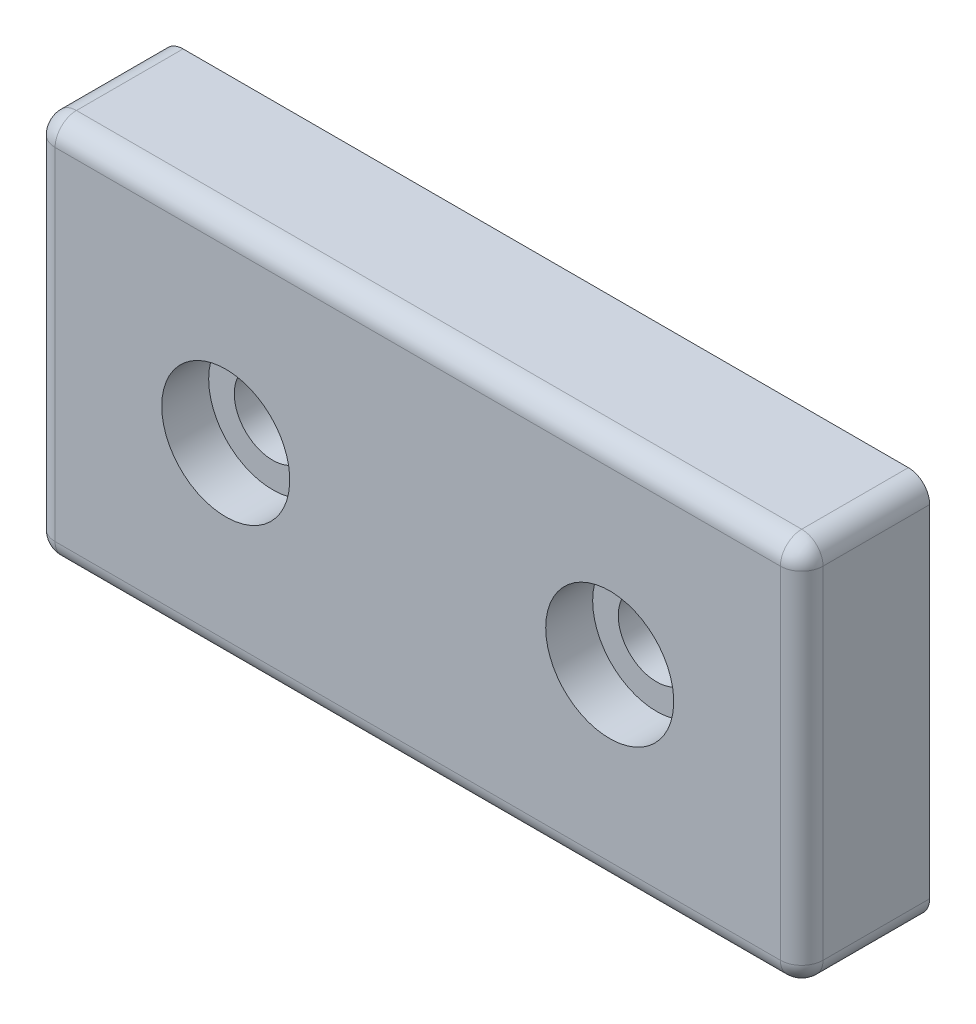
ISO-10303-21;
HEADER;
FILE_DESCRIPTION(('STEP AP214'),'2;1');
FILE_NAME('part.step','',(''),(''),'','','');
FILE_SCHEMA(('AUTOMOTIVE_DESIGN { 1 0 10303 214 1 1 1 1 }'));
ENDSEC;
DATA;
#1=APPLICATION_CONTEXT('core data for automotive mechanical design processes');
#2=APPLICATION_PROTOCOL_DEFINITION('international standard','automotive_design',2000,#1);
#3=PRODUCT_CONTEXT('',#1,'mechanical');
#4=PRODUCT('Part','Part','',(#3));
#5=PRODUCT_RELATED_PRODUCT_CATEGORY('part','',(#4));
#6=PRODUCT_DEFINITION_FORMATION('','',#4);
#7=PRODUCT_DEFINITION_CONTEXT('part definition',#1,'design');
#8=PRODUCT_DEFINITION('design','',#6,#7);
#9=PRODUCT_DEFINITION_SHAPE('','',#8);
#10=(LENGTH_UNIT() NAMED_UNIT(*) SI_UNIT(.MILLI.,.METRE.));
#11=(NAMED_UNIT(*) PLANE_ANGLE_UNIT() SI_UNIT($,.RADIAN.));
#12=(NAMED_UNIT(*) SI_UNIT($,.STERADIAN.) SOLID_ANGLE_UNIT());
#13=UNCERTAINTY_MEASURE_WITH_UNIT(LENGTH_MEASURE(1.E-05),#10,'distance_accuracy_value','');
#14=(GEOMETRIC_REPRESENTATION_CONTEXT(3) GLOBAL_UNCERTAINTY_ASSIGNED_CONTEXT((#13)) GLOBAL_UNIT_ASSIGNED_CONTEXT((#10,
#11,#12)) REPRESENTATION_CONTEXT('',''));
#15=CARTESIAN_POINT('',(0.,0.,0.));
#16=DIRECTION('',(0.,0.,1.));
#17=DIRECTION('',(1.,0.,0.));
#18=AXIS2_PLACEMENT_3D('',#15,#16,#17);
#19=CARTESIAN_POINT('',(0.,0.,15.));
#20=DIRECTION('',(0.,0.,1.));
#21=DIRECTION('',(1.,0.,0.));
#22=AXIS2_PLACEMENT_3D('',#19,#20,#21);
#23=PLANE('',#22);
#24=CARTESIAN_POINT('',(22.5,0.,15.));
#25=DIRECTION('',(0.,0.,-1.));
#26=DIRECTION('',(-1.,0.,0.));
#27=AXIS2_PLACEMENT_3D('',#24,#25,#26);
#28=CIRCLE('',#27,7.5);
#29=CARTESIAN_POINT('',(15.,0.,15.));
#30=VERTEX_POINT('',#29);
#31=EDGE_CURVE('E106',#30,#30,#28,.T.);
#32=ORIENTED_EDGE('',*,*,#31,.T.);
#33=EDGE_LOOP('',(#32));
#34=FACE_BOUND('',#33,.T.);
#35=CARTESIAN_POINT('',(-22.5,0.,15.));
#36=DIRECTION('',(0.,0.,-1.));
#37=DIRECTION('',(-1.,0.,0.));
#38=AXIS2_PLACEMENT_3D('',#35,#36,#37);
#39=CIRCLE('',#38,7.5);
#40=CARTESIAN_POINT('',(-30.,0.,15.));
#41=VERTEX_POINT('',#40);
#42=EDGE_CURVE('E19',#41,#41,#39,.T.);
#43=ORIENTED_EDGE('',*,*,#42,.T.);
#44=EDGE_LOOP('',(#43));
#45=FACE_BOUND('',#44,.T.);
#46=DIRECTION('',(-1.,0.,0.));
#47=VECTOR('',#46,1.);
#48=CARTESIAN_POINT('',(22.5,-20.,15.));
#49=LINE('',#48,#47);
#50=CARTESIAN_POINT('',(42.5,-20.0000000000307,15.));
#51=VERTEX_POINT('',#50);
#52=CARTESIAN_POINT('',(-42.5,-20.,15.));
#53=VERTEX_POINT('',#52);
#54=EDGE_CURVE('E315',#51,#53,#49,.T.);
#55=ORIENTED_EDGE('',*,*,#54,.F.);
#56=DIRECTION('',(0.,-1.,0.));
#57=VECTOR('',#56,1.);
#58=CARTESIAN_POINT('',(42.5,11.25,15.));
#59=LINE('',#58,#57);
#60=CARTESIAN_POINT('',(42.5,20.,15.));
#61=VERTEX_POINT('',#60);
#62=EDGE_CURVE('E194',#61,#51,#59,.T.);
#63=ORIENTED_EDGE('',*,*,#62,.F.);
#64=DIRECTION('',(1.,0.,0.));
#65=VECTOR('',#64,1.);
#66=CARTESIAN_POINT('',(-22.5,20.,15.));
#67=LINE('',#66,#65);
#68=CARTESIAN_POINT('',(-42.5,20.0000000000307,15.));
#69=VERTEX_POINT('',#68);
#70=EDGE_CURVE('E108',#69,#61,#67,.T.);
#71=ORIENTED_EDGE('',*,*,#70,.F.);
#72=DIRECTION('',(0.,1.,0.));
#73=VECTOR('',#72,1.);
#74=CARTESIAN_POINT('',(-42.5,-11.25,15.));
#75=LINE('',#74,#73);
#76=EDGE_CURVE('E237',#53,#69,#75,.T.);
#77=ORIENTED_EDGE('',*,*,#76,.F.);
#78=EDGE_LOOP('',(#55,#63,#71,#77));
#79=FACE_BOUND('',#78,.T.);
#80=ADVANCED_FACE('F15',(#34,#45,#79),#23,.T.);
#81=CARTESIAN_POINT('',(-22.5,0.,15.));
#82=DIRECTION('',(0.,0.,-1.));
#83=DIRECTION('',(-1.,0.,0.));
#84=AXIS2_PLACEMENT_3D('',#81,#82,#83);
#85=CYLINDRICAL_SURFACE('',#84,7.5);
#86=CARTESIAN_POINT('',(-22.5,0.,9.5));
#87=DIRECTION('',(0.,0.,-1.));
#88=DIRECTION('',(-1.,0.,0.));
#89=AXIS2_PLACEMENT_3D('',#86,#87,#88);
#90=CIRCLE('',#89,7.5);
#91=CARTESIAN_POINT('',(-30.,0.,9.5));
#92=VERTEX_POINT('',#91);
#93=EDGE_CURVE('E103',#92,#92,#90,.T.);
#94=ORIENTED_EDGE('',*,*,#93,.T.);
#95=EDGE_LOOP('',(#94));
#96=FACE_BOUND('',#95,.T.);
#97=ORIENTED_EDGE('',*,*,#42,.F.);
#98=EDGE_LOOP('',(#97));
#99=FACE_BOUND('',#98,.T.);
#100=ADVANCED_FACE('F119',(#96,#99),#85,.F.);
#101=CARTESIAN_POINT('',(22.5,0.,15.));
#102=DIRECTION('',(0.,0.,-1.));
#103=DIRECTION('',(-1.,0.,0.));
#104=AXIS2_PLACEMENT_3D('',#101,#102,#103);
#105=CYLINDRICAL_SURFACE('',#104,7.5);
#106=CARTESIAN_POINT('',(22.5,0.,9.5));
#107=DIRECTION('',(0.,0.,-1.));
#108=DIRECTION('',(-1.,0.,0.));
#109=AXIS2_PLACEMENT_3D('',#106,#107,#108);
#110=CIRCLE('',#109,7.5);
#111=CARTESIAN_POINT('',(15.,0.,9.5));
#112=VERTEX_POINT('',#111);
#113=EDGE_CURVE('E99',#112,#112,#110,.T.);
#114=ORIENTED_EDGE('',*,*,#113,.T.);
#115=EDGE_LOOP('',(#114));
#116=FACE_BOUND('',#115,.T.);
#117=ORIENTED_EDGE('',*,*,#31,.F.);
#118=EDGE_LOOP('',(#117));
#119=FACE_BOUND('',#118,.T.);
#120=ADVANCED_FACE('F121',(#116,#119),#105,.F.);
#121=CARTESIAN_POINT('',(-22.5,20.,12.5));
#122=DIRECTION('',(1.,0.,0.));
#123=DIRECTION('',(0.,1.,0.));
#124=AXIS2_PLACEMENT_3D('',#121,#122,#123);
#125=CYLINDRICAL_SURFACE('',#124,2.5);
#126=CARTESIAN_POINT('',(-42.5,20.,12.5));
#127=DIRECTION('',(1.,0.,0.));
#128=DIRECTION('',(0.,1.,0.));
#129=AXIS2_PLACEMENT_3D('',#126,#127,#128);
#130=CIRCLE('',#129,2.5);
#131=CARTESIAN_POINT('',(-42.5,22.5,12.5));
#132=VERTEX_POINT('',#131);
#133=EDGE_CURVE('E112',#69,#132,#130,.F.);
#134=ORIENTED_EDGE('',*,*,#133,.F.);
#135=ORIENTED_EDGE('',*,*,#70,.T.);
#136=CARTESIAN_POINT('',(42.5,20.,12.5));
#137=DIRECTION('',(1.,0.,0.));
#138=DIRECTION('',(0.,1.,0.));
#139=AXIS2_PLACEMENT_3D('',#136,#137,#138);
#140=CIRCLE('',#139,2.5);
#141=CARTESIAN_POINT('',(42.5,22.5,12.5));
#142=VERTEX_POINT('',#141);
#143=EDGE_CURVE('E191',#142,#61,#140,.T.);
#144=ORIENTED_EDGE('',*,*,#143,.F.);
#145=DIRECTION('',(1.,0.,0.));
#146=VECTOR('',#145,1.);
#147=CARTESIAN_POINT('',(-45.,22.5,12.5));
#148=LINE('',#147,#146);
#149=EDGE_CURVE('E102',#132,#142,#148,.T.);
#150=ORIENTED_EDGE('',*,*,#149,.F.);
#151=EDGE_LOOP('',(#134,#135,#144,#150));
#152=FACE_BOUND('',#151,.T.);
#153=ADVANCED_FACE('F129',(#152),#125,.T.);
#154=CARTESIAN_POINT('',(-42.5,20.,12.5));
#155=DIRECTION('',(1.,0.,0.));
#156=DIRECTION('',(0.,1.,0.));
#157=AXIS2_PLACEMENT_3D('',#154,#155,#156);
#158=SPHERICAL_SURFACE('',#157,2.5);
#159=ORIENTED_EDGE('',*,*,#133,.T.);
#160=CARTESIAN_POINT('',(-42.5,20.,12.5));
#161=DIRECTION('',(0.,0.,1.));
#162=DIRECTION('',(1.,0.,0.));
#163=AXIS2_PLACEMENT_3D('',#160,#161,#162);
#164=CIRCLE('',#163,2.5);
#165=CARTESIAN_POINT('',(-45.,20.,12.5));
#166=VERTEX_POINT('',#165);
#167=EDGE_CURVE('E197',#166,#132,#164,.F.);
#168=ORIENTED_EDGE('',*,*,#167,.F.);
#169=CARTESIAN_POINT('',(-42.5,20.,12.5));
#170=DIRECTION('',(0.,1.,0.));
#171=DIRECTION('',(-1.,0.,0.));
#172=AXIS2_PLACEMENT_3D('',#169,#170,#171);
#173=CIRCLE('',#172,2.5);
#174=EDGE_CURVE('E238',#69,#166,#173,.F.);
#175=ORIENTED_EDGE('',*,*,#174,.F.);
#176=EDGE_LOOP('',(#159,#168,#175));
#177=FACE_BOUND('',#176,.T.);
#178=ADVANCED_FACE('F245',(#177),#158,.T.);
#179=CARTESIAN_POINT('',(-42.5,-11.25,12.5));
#180=DIRECTION('',(0.,1.,0.));
#181=DIRECTION('',(-1.,0.,0.));
#182=AXIS2_PLACEMENT_3D('',#179,#180,#181);
#183=CYLINDRICAL_SURFACE('',#182,2.5);
#184=CARTESIAN_POINT('',(-42.5,-20.,12.5));
#185=DIRECTION('',(0.,-1.,0.));
#186=DIRECTION('',(1.,0.,0.));
#187=AXIS2_PLACEMENT_3D('',#184,#185,#186);
#188=CIRCLE('',#187,2.5);
#189=CARTESIAN_POINT('',(-45.,-20.,12.5));
#190=VERTEX_POINT('',#189);
#191=EDGE_CURVE('E233',#53,#190,#188,.T.);
#192=ORIENTED_EDGE('',*,*,#191,.F.);
#193=ORIENTED_EDGE('',*,*,#76,.T.);
#194=ORIENTED_EDGE('',*,*,#174,.T.);
#195=DIRECTION('',(0.,1.,0.));
#196=VECTOR('',#195,1.);
#197=CARTESIAN_POINT('',(-45.,-22.5,12.5));
#198=LINE('',#197,#196);
#199=EDGE_CURVE('E74',#190,#166,#198,.T.);
#200=ORIENTED_EDGE('',*,*,#199,.F.);
#201=EDGE_LOOP('',(#192,#193,#194,#200));
#202=FACE_BOUND('',#201,.T.);
#203=ADVANCED_FACE('F226',(#202),#183,.T.);
#204=CARTESIAN_POINT('',(-42.5,-20.,12.5));
#205=DIRECTION('',(1.,0.,0.));
#206=DIRECTION('',(0.,1.,0.));
#207=AXIS2_PLACEMENT_3D('',#204,#205,#206);
#208=SPHERICAL_SURFACE('',#207,2.5);
#209=ORIENTED_EDGE('',*,*,#191,.T.);
#210=CARTESIAN_POINT('',(-42.5,-20.,12.5));
#211=DIRECTION('',(0.,0.,1.));
#212=DIRECTION('',(1.,0.,0.));
#213=AXIS2_PLACEMENT_3D('',#210,#211,#212);
#214=CIRCLE('',#213,2.5);
#215=CARTESIAN_POINT('',(-42.5,-22.5,12.5));
#216=VERTEX_POINT('',#215);
#217=EDGE_CURVE('E310',#216,#190,#214,.F.);
#218=ORIENTED_EDGE('',*,*,#217,.F.);
#219=CARTESIAN_POINT('',(-42.5,-20.,12.5));
#220=DIRECTION('',(-1.,0.,0.));
#221=DIRECTION('',(0.,0.,1.));
#222=AXIS2_PLACEMENT_3D('',#219,#220,#221);
#223=CIRCLE('',#222,2.5);
#224=EDGE_CURVE('E236',#53,#216,#223,.F.);
#225=ORIENTED_EDGE('',*,*,#224,.F.);
#226=EDGE_LOOP('',(#209,#218,#225));
#227=FACE_BOUND('',#226,.T.);
#228=ADVANCED_FACE('F221',(#227),#208,.T.);
#229=CARTESIAN_POINT('',(22.5,-20.,12.5));
#230=DIRECTION('',(-1.,0.,0.));
#231=DIRECTION('',(0.,0.,1.));
#232=AXIS2_PLACEMENT_3D('',#229,#230,#231);
#233=CYLINDRICAL_SURFACE('',#232,2.5);
#234=CARTESIAN_POINT('',(42.5,-20.,12.5));
#235=DIRECTION('',(1.,0.,0.));
#236=DIRECTION('',(0.,1.,0.));
#237=AXIS2_PLACEMENT_3D('',#234,#235,#236);
#238=CIRCLE('',#237,2.5);
#239=CARTESIAN_POINT('',(42.5,-22.5,12.5));
#240=VERTEX_POINT('',#239);
#241=EDGE_CURVE('E206',#51,#240,#238,.T.);
#242=ORIENTED_EDGE('',*,*,#241,.F.);
#243=ORIENTED_EDGE('',*,*,#54,.T.);
#244=ORIENTED_EDGE('',*,*,#224,.T.);
#245=DIRECTION('',(1.,0.,0.));
#246=VECTOR('',#245,1.);
#247=CARTESIAN_POINT('',(45.,-22.5,12.5));
#248=LINE('',#247,#246);
#249=EDGE_CURVE('E207',#240,#216,#248,.F.);
#250=ORIENTED_EDGE('',*,*,#249,.F.);
#251=EDGE_LOOP('',(#242,#243,#244,#250));
#252=FACE_BOUND('',#251,.T.);
#253=ADVANCED_FACE('F217',(#252),#233,.T.);
#254=CARTESIAN_POINT('',(42.5,-20.,12.5));
#255=DIRECTION('',(1.,0.,0.));
#256=DIRECTION('',(0.,1.,0.));
#257=AXIS2_PLACEMENT_3D('',#254,#255,#256);
#258=SPHERICAL_SURFACE('',#257,2.5);
#259=CARTESIAN_POINT('',(42.5,-20.,12.5));
#260=DIRECTION('',(0.,-1.,0.));
#261=DIRECTION('',(1.,0.,0.));
#262=AXIS2_PLACEMENT_3D('',#259,#260,#261);
#263=CIRCLE('',#262,2.5);
#264=CARTESIAN_POINT('',(45.,-20.,12.5));
#265=VERTEX_POINT('',#264);
#266=EDGE_CURVE('E203',#51,#265,#263,.F.);
#267=ORIENTED_EDGE('',*,*,#266,.F.);
#268=ORIENTED_EDGE('',*,*,#241,.T.);
#269=CARTESIAN_POINT('',(42.5,-20.,12.5));
#270=DIRECTION('',(0.,0.,1.));
#271=DIRECTION('',(1.,0.,0.));
#272=AXIS2_PLACEMENT_3D('',#269,#270,#271);
#273=CIRCLE('',#272,2.5);
#274=EDGE_CURVE('E198',#265,#240,#273,.F.);
#275=ORIENTED_EDGE('',*,*,#274,.F.);
#276=EDGE_LOOP('',(#267,#268,#275));
#277=FACE_BOUND('',#276,.T.);
#278=ADVANCED_FACE('F214',(#277),#258,.T.);
#279=CARTESIAN_POINT('',(42.5,11.25,12.5));
#280=DIRECTION('',(0.,-1.,0.));
#281=DIRECTION('',(1.,0.,0.));
#282=AXIS2_PLACEMENT_3D('',#279,#280,#281);
#283=CYLINDRICAL_SURFACE('',#282,2.5);
#284=CARTESIAN_POINT('',(42.5,20.,12.5));
#285=DIRECTION('',(0.,-1.,0.));
#286=DIRECTION('',(1.,0.,0.));
#287=AXIS2_PLACEMENT_3D('',#284,#285,#286);
#288=CIRCLE('',#287,2.5);
#289=CARTESIAN_POINT('',(45.,20.,12.5));
#290=VERTEX_POINT('',#289);
#291=EDGE_CURVE('E105',#61,#290,#288,.F.);
#292=ORIENTED_EDGE('',*,*,#291,.F.);
#293=ORIENTED_EDGE('',*,*,#62,.T.);
#294=ORIENTED_EDGE('',*,*,#266,.T.);
#295=DIRECTION('',(0.,1.,0.));
#296=VECTOR('',#295,1.);
#297=CARTESIAN_POINT('',(45.,22.5,12.5));
#298=LINE('',#297,#296);
#299=EDGE_CURVE('E298',#290,#265,#298,.F.);
#300=ORIENTED_EDGE('',*,*,#299,.F.);
#301=EDGE_LOOP('',(#292,#293,#294,#300));
#302=FACE_BOUND('',#301,.T.);
#303=ADVANCED_FACE('F181',(#302),#283,.T.);
#304=CARTESIAN_POINT('',(42.5,20.,12.5));
#305=DIRECTION('',(1.,0.,0.));
#306=DIRECTION('',(0.,1.,0.));
#307=AXIS2_PLACEMENT_3D('',#304,#305,#306);
#308=SPHERICAL_SURFACE('',#307,2.5);
#309=ORIENTED_EDGE('',*,*,#143,.T.);
#310=ORIENTED_EDGE('',*,*,#291,.T.);
#311=CARTESIAN_POINT('',(42.5,20.,12.5));
#312=DIRECTION('',(0.,0.,1.));
#313=DIRECTION('',(1.,0.,0.));
#314=AXIS2_PLACEMENT_3D('',#311,#312,#313);
#315=CIRCLE('',#314,2.5);
#316=EDGE_CURVE('E187',#142,#290,#315,.F.);
#317=ORIENTED_EDGE('',*,*,#316,.F.);
#318=EDGE_LOOP('',(#309,#310,#317));
#319=FACE_BOUND('',#318,.T.);
#320=ADVANCED_FACE('F176',(#319),#308,.T.);
#321=CARTESIAN_POINT('',(-30.15,7.65,9.5));
#322=DIRECTION('',(0.,0.,-1.));
#323=DIRECTION('',(1.,0.,0.));
#324=AXIS2_PLACEMENT_3D('',#321,#322,#323);
#325=PLANE('',#324);
#326=CARTESIAN_POINT('',(-22.5,0.,9.5));
#327=DIRECTION('',(0.,0.,1.));
#328=DIRECTION('',(1.,0.,0.));
#329=AXIS2_PLACEMENT_3D('',#326,#327,#328);
#330=CIRCLE('',#329,4.5);
#331=CARTESIAN_POINT('',(-18.,0.,9.5));
#332=VERTEX_POINT('',#331);
#333=EDGE_CURVE('E96',#332,#332,#330,.F.);
#334=ORIENTED_EDGE('',*,*,#333,.T.);
#335=EDGE_LOOP('',(#334));
#336=FACE_BOUND('',#335,.T.);
#337=ORIENTED_EDGE('',*,*,#93,.F.);
#338=EDGE_LOOP('',(#337));
#339=FACE_BOUND('',#338,.T.);
#340=ADVANCED_FACE('F180',(#336,#339),#325,.F.);
#341=CARTESIAN_POINT('',(14.85,7.65,9.5));
#342=DIRECTION('',(0.,0.,-1.));
#343=DIRECTION('',(1.,0.,0.));
#344=AXIS2_PLACEMENT_3D('',#341,#342,#343);
#345=PLANE('',#344);
#346=CARTESIAN_POINT('',(22.5,0.,9.5));
#347=DIRECTION('',(0.,0.,1.));
#348=DIRECTION('',(1.,0.,0.));
#349=AXIS2_PLACEMENT_3D('',#346,#347,#348);
#350=CIRCLE('',#349,4.5);
#351=CARTESIAN_POINT('',(27.,0.,9.5));
#352=VERTEX_POINT('',#351);
#353=EDGE_CURVE('E89',#352,#352,#350,.F.);
#354=ORIENTED_EDGE('',*,*,#353,.T.);
#355=EDGE_LOOP('',(#354));
#356=FACE_BOUND('',#355,.T.);
#357=ORIENTED_EDGE('',*,*,#113,.F.);
#358=EDGE_LOOP('',(#357));
#359=FACE_BOUND('',#358,.T.);
#360=ADVANCED_FACE('F17',(#356,#359),#345,.F.);
#361=CARTESIAN_POINT('',(-45.,22.5,0.));
#362=DIRECTION('',(0.,1.,0.));
#363=DIRECTION('',(0.,0.,1.));
#364=AXIS2_PLACEMENT_3D('',#361,#362,#363);
#365=PLANE('',#364);
#366=DIRECTION('',(0.,0.,1.));
#367=VECTOR('',#366,1.);
#368=CARTESIAN_POINT('',(-42.5,22.5,0.));
#369=LINE('',#368,#367);
#370=CARTESIAN_POINT('',(-42.5,22.5,0.));
#371=VERTEX_POINT('',#370);
#372=EDGE_CURVE('E60',#132,#371,#369,.F.);
#373=ORIENTED_EDGE('',*,*,#372,.F.);
#374=ORIENTED_EDGE('',*,*,#149,.T.);
#375=DIRECTION('',(0.,0.,1.));
#376=VECTOR('',#375,1.);
#377=CARTESIAN_POINT('',(42.5,22.5,0.));
#378=LINE('',#377,#376);
#379=CARTESIAN_POINT('',(42.5,22.5,0.));
#380=VERTEX_POINT('',#379);
#381=EDGE_CURVE('E296',#380,#142,#378,.T.);
#382=ORIENTED_EDGE('',*,*,#381,.F.);
#383=DIRECTION('',(1.,0.,0.));
#384=VECTOR('',#383,1.);
#385=CARTESIAN_POINT('',(0.,22.5,0.));
#386=LINE('',#385,#384);
#387=EDGE_CURVE('E87',#380,#371,#386,.F.);
#388=ORIENTED_EDGE('',*,*,#387,.T.);
#389=EDGE_LOOP('',(#373,#374,#382,#388));
#390=FACE_BOUND('',#389,.T.);
#391=ADVANCED_FACE('F172',(#390),#365,.T.);
#392=CARTESIAN_POINT('',(-42.5,20.,0.));
#393=DIRECTION('',(0.,0.,1.));
#394=DIRECTION('',(1.,0.,0.));
#395=AXIS2_PLACEMENT_3D('',#392,#393,#394);
#396=CYLINDRICAL_SURFACE('',#395,2.5);
#397=ORIENTED_EDGE('',*,*,#167,.T.);
#398=ORIENTED_EDGE('',*,*,#372,.T.);
#399=CARTESIAN_POINT('',(-42.5,20.,0.));
#400=DIRECTION('',(0.,0.,1.));
#401=DIRECTION('',(1.,0.,0.));
#402=AXIS2_PLACEMENT_3D('',#399,#400,#401);
#403=CIRCLE('',#402,2.5);
#404=CARTESIAN_POINT('',(-45.,20.,0.));
#405=VERTEX_POINT('',#404);
#406=EDGE_CURVE('E80',#371,#405,#403,.T.);
#407=ORIENTED_EDGE('',*,*,#406,.T.);
#408=DIRECTION('',(0.,0.,1.));
#409=VECTOR('',#408,1.);
#410=CARTESIAN_POINT('',(-45.,20.,0.));
#411=LINE('',#410,#409);
#412=EDGE_CURVE('E67',#166,#405,#411,.F.);
#413=ORIENTED_EDGE('',*,*,#412,.F.);
#414=EDGE_LOOP('',(#397,#398,#407,#413));
#415=FACE_BOUND('',#414,.T.);
#416=ADVANCED_FACE('F86',(#415),#396,.T.);
#417=CARTESIAN_POINT('',(-45.,-22.5,0.));
#418=DIRECTION('',(-1.,0.,0.));
#419=DIRECTION('',(0.,0.,1.));
#420=AXIS2_PLACEMENT_3D('',#417,#418,#419);
#421=PLANE('',#420);
#422=DIRECTION('',(0.,0.,1.));
#423=VECTOR('',#422,1.);
#424=CARTESIAN_POINT('',(-45.,-20.,0.));
#425=LINE('',#424,#423);
#426=CARTESIAN_POINT('',(-45.,-20.,0.));
#427=VERTEX_POINT('',#426);
#428=EDGE_CURVE('E210',#190,#427,#425,.F.);
#429=ORIENTED_EDGE('',*,*,#428,.F.);
#430=ORIENTED_EDGE('',*,*,#199,.T.);
#431=ORIENTED_EDGE('',*,*,#412,.T.);
#432=DIRECTION('',(0.,1.,0.));
#433=VECTOR('',#432,1.);
#434=CARTESIAN_POINT('',(-45.,0.,0.));
#435=LINE('',#434,#433);
#436=EDGE_CURVE('E71',#405,#427,#435,.F.);
#437=ORIENTED_EDGE('',*,*,#436,.T.);
#438=EDGE_LOOP('',(#429,#430,#431,#437));
#439=FACE_BOUND('',#438,.T.);
#440=ADVANCED_FACE('F70',(#439),#421,.T.);
#441=CARTESIAN_POINT('',(-42.5,-20.,0.));
#442=DIRECTION('',(0.,0.,1.));
#443=DIRECTION('',(1.,0.,0.));
#444=AXIS2_PLACEMENT_3D('',#441,#442,#443);
#445=CYLINDRICAL_SURFACE('',#444,2.5);
#446=ORIENTED_EDGE('',*,*,#217,.T.);
#447=ORIENTED_EDGE('',*,*,#428,.T.);
#448=CARTESIAN_POINT('',(-42.5,-20.,0.));
#449=DIRECTION('',(0.,0.,1.));
#450=DIRECTION('',(1.,0.,0.));
#451=AXIS2_PLACEMENT_3D('',#448,#449,#450);
#452=CIRCLE('',#451,2.5);
#453=CARTESIAN_POINT('',(-42.5,-22.5,0.));
#454=VERTEX_POINT('',#453);
#455=EDGE_CURVE('E84',#427,#454,#452,.T.);
#456=ORIENTED_EDGE('',*,*,#455,.T.);
#457=DIRECTION('',(0.,0.,-1.));
#458=VECTOR('',#457,1.);
#459=CARTESIAN_POINT('',(-42.5,-22.5,0.));
#460=LINE('',#459,#458);
#461=EDGE_CURVE('E202',#216,#454,#460,.T.);
#462=ORIENTED_EDGE('',*,*,#461,.F.);
#463=EDGE_LOOP('',(#446,#447,#456,#462));
#464=FACE_BOUND('',#463,.T.);
#465=ADVANCED_FACE('F163',(#464),#445,.T.);
#466=CARTESIAN_POINT('',(45.,-22.5,0.));
#467=DIRECTION('',(0.,-1.,0.));
#468=DIRECTION('',(0.,0.,-1.));
#469=AXIS2_PLACEMENT_3D('',#466,#467,#468);
#470=PLANE('',#469);
#471=ORIENTED_EDGE('',*,*,#461,.T.);
#472=DIRECTION('',(1.,0.,0.));
#473=VECTOR('',#472,1.);
#474=CARTESIAN_POINT('',(0.,-22.5,0.));
#475=LINE('',#474,#473);
#476=CARTESIAN_POINT('',(42.5,-22.5,0.));
#477=VERTEX_POINT('',#476);
#478=EDGE_CURVE('E326',#454,#477,#475,.T.);
#479=ORIENTED_EDGE('',*,*,#478,.T.);
#480=DIRECTION('',(0.,0.,1.));
#481=VECTOR('',#480,1.);
#482=CARTESIAN_POINT('',(42.5,-22.5,0.));
#483=LINE('',#482,#481);
#484=EDGE_CURVE('E201',#240,#477,#483,.F.);
#485=ORIENTED_EDGE('',*,*,#484,.F.);
#486=ORIENTED_EDGE('',*,*,#249,.T.);
#487=EDGE_LOOP('',(#471,#479,#485,#486));
#488=FACE_BOUND('',#487,.T.);
#489=ADVANCED_FACE('F159',(#488),#470,.T.);
#490=CARTESIAN_POINT('',(42.5,-20.,0.));
#491=DIRECTION('',(0.,0.,1.));
#492=DIRECTION('',(1.,0.,0.));
#493=AXIS2_PLACEMENT_3D('',#490,#491,#492);
#494=CYLINDRICAL_SURFACE('',#493,2.5);
#495=ORIENTED_EDGE('',*,*,#274,.T.);
#496=ORIENTED_EDGE('',*,*,#484,.T.);
#497=CARTESIAN_POINT('',(42.5,-20.,0.));
#498=DIRECTION('',(0.,0.,1.));
#499=DIRECTION('',(1.,0.,0.));
#500=AXIS2_PLACEMENT_3D('',#497,#498,#499);
#501=CIRCLE('',#500,2.5);
#502=CARTESIAN_POINT('',(45.,-20.,0.));
#503=VERTEX_POINT('',#502);
#504=EDGE_CURVE('E324',#477,#503,#501,.T.);
#505=ORIENTED_EDGE('',*,*,#504,.T.);
#506=DIRECTION('',(0.,0.,-1.));
#507=VECTOR('',#506,1.);
#508=CARTESIAN_POINT('',(45.,-20.,0.));
#509=LINE('',#508,#507);
#510=EDGE_CURVE('E301',#265,#503,#509,.T.);
#511=ORIENTED_EDGE('',*,*,#510,.F.);
#512=EDGE_LOOP('',(#495,#496,#505,#511));
#513=FACE_BOUND('',#512,.T.);
#514=ADVANCED_FACE('F155',(#513),#494,.T.);
#515=CARTESIAN_POINT('',(45.,22.5,0.));
#516=DIRECTION('',(1.,0.,0.));
#517=DIRECTION('',(0.,0.,-1.));
#518=AXIS2_PLACEMENT_3D('',#515,#516,#517);
#519=PLANE('',#518);
#520=ORIENTED_EDGE('',*,*,#510,.T.);
#521=DIRECTION('',(0.,1.,0.));
#522=VECTOR('',#521,1.);
#523=CARTESIAN_POINT('',(45.,0.,0.));
#524=LINE('',#523,#522);
#525=CARTESIAN_POINT('',(45.,20.,0.));
#526=VERTEX_POINT('',#525);
#527=EDGE_CURVE('E303',#503,#526,#524,.T.);
#528=ORIENTED_EDGE('',*,*,#527,.T.);
#529=DIRECTION('',(0.,0.,1.));
#530=VECTOR('',#529,1.);
#531=CARTESIAN_POINT('',(45.,20.,0.));
#532=LINE('',#531,#530);
#533=EDGE_CURVE('E34',#290,#526,#532,.F.);
#534=ORIENTED_EDGE('',*,*,#533,.F.);
#535=ORIENTED_EDGE('',*,*,#299,.T.);
#536=EDGE_LOOP('',(#520,#528,#534,#535));
#537=FACE_BOUND('',#536,.T.);
#538=ADVANCED_FACE('F152',(#537),#519,.T.);
#539=CARTESIAN_POINT('',(42.5,20.,0.));
#540=DIRECTION('',(0.,0.,1.));
#541=DIRECTION('',(1.,0.,0.));
#542=AXIS2_PLACEMENT_3D('',#539,#540,#541);
#543=CYLINDRICAL_SURFACE('',#542,2.5);
#544=ORIENTED_EDGE('',*,*,#316,.T.);
#545=ORIENTED_EDGE('',*,*,#533,.T.);
#546=CARTESIAN_POINT('',(42.5,20.,0.));
#547=DIRECTION('',(0.,0.,1.));
#548=DIRECTION('',(1.,0.,0.));
#549=AXIS2_PLACEMENT_3D('',#546,#547,#548);
#550=CIRCLE('',#549,2.5);
#551=EDGE_CURVE('E323',#526,#380,#550,.T.);
#552=ORIENTED_EDGE('',*,*,#551,.T.);
#553=ORIENTED_EDGE('',*,*,#381,.T.);
#554=EDGE_LOOP('',(#544,#545,#552,#553));
#555=FACE_BOUND('',#554,.T.);
#556=ADVANCED_FACE('F148',(#555),#543,.T.);
#557=CARTESIAN_POINT('',(-22.5,0.,0.));
#558=DIRECTION('',(0.,0.,1.));
#559=DIRECTION('',(1.,0.,0.));
#560=AXIS2_PLACEMENT_3D('',#557,#558,#559);
#561=CYLINDRICAL_SURFACE('',#560,4.5);
#562=CARTESIAN_POINT('',(-22.5,0.,0.));
#563=DIRECTION('',(0.,0.,1.));
#564=DIRECTION('',(1.,0.,0.));
#565=AXIS2_PLACEMENT_3D('',#562,#563,#564);
#566=CIRCLE('',#565,4.5);
#567=CARTESIAN_POINT('',(-18.,0.,0.));
#568=VERTEX_POINT('',#567);
#569=EDGE_CURVE('E25',#568,#568,#566,.F.);
#570=ORIENTED_EDGE('',*,*,#569,.T.);
#571=EDGE_LOOP('',(#570));
#572=FACE_BOUND('',#571,.T.);
#573=ORIENTED_EDGE('',*,*,#333,.F.);
#574=EDGE_LOOP('',(#573));
#575=FACE_BOUND('',#574,.T.);
#576=ADVANCED_FACE('F140',(#572,#575),#561,.F.);
#577=CARTESIAN_POINT('',(22.5,0.,0.));
#578=DIRECTION('',(0.,0.,1.));
#579=DIRECTION('',(1.,0.,0.));
#580=AXIS2_PLACEMENT_3D('',#577,#578,#579);
#581=CYLINDRICAL_SURFACE('',#580,4.5);
#582=CARTESIAN_POINT('',(22.5,0.,0.));
#583=DIRECTION('',(0.,0.,1.));
#584=DIRECTION('',(1.,0.,0.));
#585=AXIS2_PLACEMENT_3D('',#582,#583,#584);
#586=CIRCLE('',#585,4.5);
#587=CARTESIAN_POINT('',(27.,0.,0.));
#588=VERTEX_POINT('',#587);
#589=EDGE_CURVE('E10',#588,#588,#586,.F.);
#590=ORIENTED_EDGE('',*,*,#589,.T.);
#591=EDGE_LOOP('',(#590));
#592=FACE_BOUND('',#591,.T.);
#593=ORIENTED_EDGE('',*,*,#353,.F.);
#594=EDGE_LOOP('',(#593));
#595=FACE_BOUND('',#594,.T.);
#596=ADVANCED_FACE('F134',(#592,#595),#581,.F.);
#597=CARTESIAN_POINT('',(0.,0.,0.));
#598=DIRECTION('',(0.,0.,1.));
#599=DIRECTION('',(1.,0.,0.));
#600=AXIS2_PLACEMENT_3D('',#597,#598,#599);
#601=PLANE('',#600);
#602=ORIENTED_EDGE('',*,*,#589,.F.);
#603=EDGE_LOOP('',(#602));
#604=FACE_BOUND('',#603,.T.);
#605=ORIENTED_EDGE('',*,*,#569,.F.);
#606=EDGE_LOOP('',(#605));
#607=FACE_BOUND('',#606,.T.);
#608=ORIENTED_EDGE('',*,*,#527,.F.);
#609=ORIENTED_EDGE('',*,*,#504,.F.);
#610=ORIENTED_EDGE('',*,*,#478,.F.);
#611=ORIENTED_EDGE('',*,*,#455,.F.);
#612=ORIENTED_EDGE('',*,*,#436,.F.);
#613=ORIENTED_EDGE('',*,*,#406,.F.);
#614=ORIENTED_EDGE('',*,*,#387,.F.);
#615=ORIENTED_EDGE('',*,*,#551,.F.);
#616=EDGE_LOOP('',(#608,#609,#610,#611,#612,#613,#614,#615));
#617=FACE_BOUND('',#616,.T.);
#618=ADVANCED_FACE('F79',(#604,#607,#617),#601,.F.);
#619=CLOSED_SHELL('',(#80,#100,#120,#153,#178,#203,#228,#253,#278,#303,#320,#340,#360,#391,#416,
#440,#465,#489,#514,#538,#556,#576,#596,#618));
#620=MANIFOLD_SOLID_BREP('B1',#619);
#621=ADVANCED_BREP_SHAPE_REPRESENTATION('',(#18,#620),#14);
#622=SHAPE_DEFINITION_REPRESENTATION(#9,#621);
ENDSEC;
END-ISO-10303-21;
